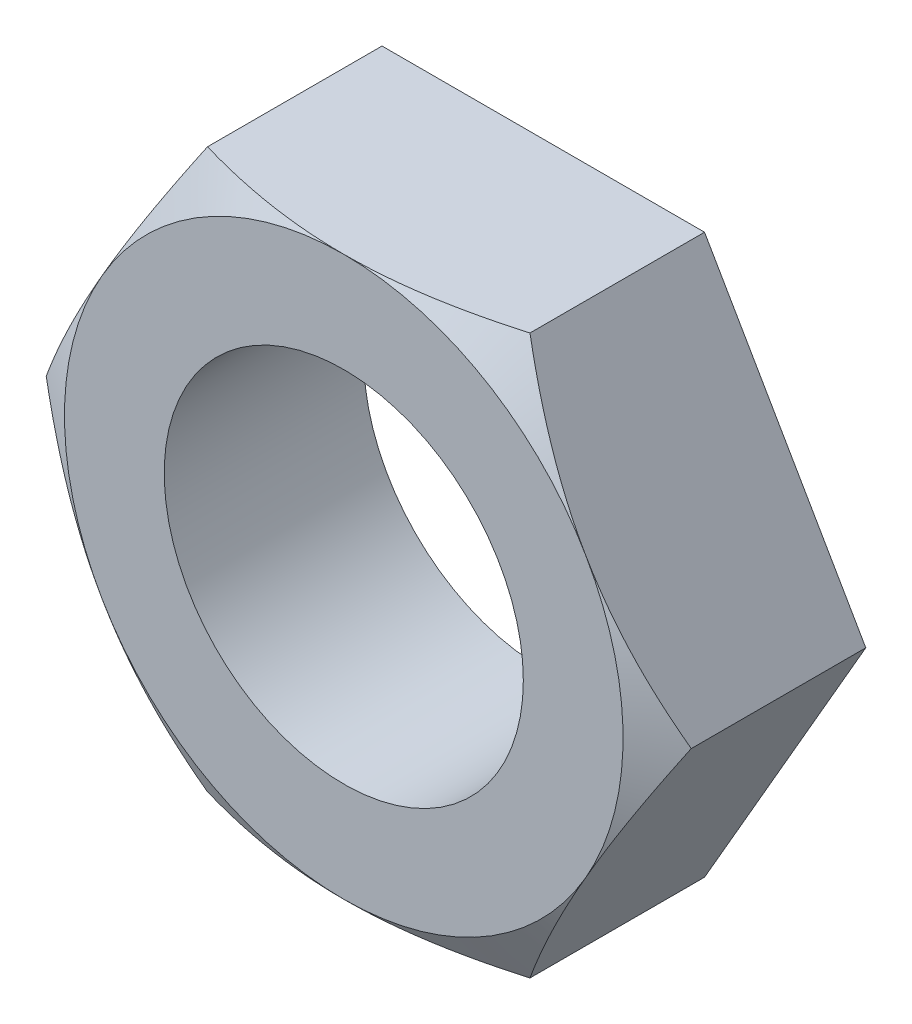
ISO-10303-21;
HEADER;
FILE_DESCRIPTION(('STEP AP214'),'2;1');
FILE_NAME('part.step','',(''),(''),'','','');
FILE_SCHEMA(('AUTOMOTIVE_DESIGN { 1 0 10303 214 1 1 1 1 }'));
ENDSEC;
DATA;
#1=APPLICATION_CONTEXT('core data for automotive mechanical design processes');
#2=APPLICATION_PROTOCOL_DEFINITION('international standard','automotive_design',2000,#1);
#3=PRODUCT_CONTEXT('',#1,'mechanical');
#4=PRODUCT('Part','Part','',(#3));
#5=PRODUCT_RELATED_PRODUCT_CATEGORY('part','',(#4));
#6=PRODUCT_DEFINITION_FORMATION('','',#4);
#7=PRODUCT_DEFINITION_CONTEXT('part definition',#1,'design');
#8=PRODUCT_DEFINITION('design','',#6,#7);
#9=PRODUCT_DEFINITION_SHAPE('','',#8);
#10=(LENGTH_UNIT() NAMED_UNIT(*) SI_UNIT(.MILLI.,.METRE.));
#11=(NAMED_UNIT(*) PLANE_ANGLE_UNIT() SI_UNIT($,.RADIAN.));
#12=(NAMED_UNIT(*) SI_UNIT($,.STERADIAN.) SOLID_ANGLE_UNIT());
#13=UNCERTAINTY_MEASURE_WITH_UNIT(LENGTH_MEASURE(1.E-05),#10,'distance_accuracy_value','');
#14=(GEOMETRIC_REPRESENTATION_CONTEXT(3) GLOBAL_UNCERTAINTY_ASSIGNED_CONTEXT((#13)) GLOBAL_UNIT_ASSIGNED_CONTEXT((#10,
#11,#12)) REPRESENTATION_CONTEXT('',''));
#15=CARTESIAN_POINT('',(0.,0.,0.));
#16=DIRECTION('',(0.,0.,1.));
#17=DIRECTION('',(1.,0.,0.));
#18=AXIS2_PLACEMENT_3D('',#15,#16,#17);
#19=CARTESIAN_POINT('',(-6.4158048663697,11.1125,7.93749999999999));
#20=DIRECTION('',(0.,0.,-1.));
#21=DIRECTION('',(-1.,0.,0.));
#22=AXIS2_PLACEMENT_3D('',#19,#20,#21);
#23=PLANE('',#22);
#24=CARTESIAN_POINT('',(0.,0.,7.93749999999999));
#25=DIRECTION('',(0.,0.,1.));
#26=DIRECTION('',(1.,0.,0.));
#27=AXIS2_PLACEMENT_3D('',#24,#25,#26);
#28=CIRCLE('',#27,7.14375);
#29=CARTESIAN_POINT('',(7.14375,0.,7.93749999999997));
#30=VERTEX_POINT('',#29);
#31=EDGE_CURVE('E174',#30,#30,#28,.T.);
#32=ORIENTED_EDGE('',*,*,#31,.F.);
#33=EDGE_LOOP('',(#32));
#34=FACE_BOUND('',#33,.T.);
#35=CARTESIAN_POINT('',(0.,0.,7.93749999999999));
#36=DIRECTION('',(0.,0.,1.));
#37=DIRECTION('',(1.,0.,0.));
#38=AXIS2_PLACEMENT_3D('',#35,#36,#37);
#39=CIRCLE('',#38,11.1125);
#40=CARTESIAN_POINT('',(0.,11.1125,7.93749999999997));
#41=VERTEX_POINT('',#40);
#42=CARTESIAN_POINT('',(-9.62370729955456,5.55624999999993,7.9375));
#43=VERTEX_POINT('',#42);
#44=EDGE_CURVE('E147',#41,#43,#39,.T.);
#45=ORIENTED_EDGE('',*,*,#44,.T.);
#46=CARTESIAN_POINT('',(-9.62370729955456,-5.55624999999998,7.9375));
#47=VERTEX_POINT('',#46);
#48=EDGE_CURVE('E295',#43,#47,#39,.T.);
#49=ORIENTED_EDGE('',*,*,#48,.T.);
#50=CARTESIAN_POINT('',(0.,-11.1125,7.93749999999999));
#51=VERTEX_POINT('',#50);
#52=EDGE_CURVE('E304',#47,#51,#39,.T.);
#53=ORIENTED_EDGE('',*,*,#52,.T.);
#54=CARTESIAN_POINT('',(9.62370729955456,-5.55624999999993,7.93749999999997));
#55=VERTEX_POINT('',#54);
#56=EDGE_CURVE('E47',#51,#55,#39,.T.);
#57=ORIENTED_EDGE('',*,*,#56,.T.);
#58=CARTESIAN_POINT('',(9.62370729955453,5.55624999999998,7.93749999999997));
#59=VERTEX_POINT('',#58);
#60=EDGE_CURVE('E55',#55,#59,#39,.T.);
#61=ORIENTED_EDGE('',*,*,#60,.T.);
#62=EDGE_CURVE('E305',#59,#41,#39,.T.);
#63=ORIENTED_EDGE('',*,*,#62,.T.);
#64=EDGE_LOOP('',(#45,#49,#53,#57,#61,#63));
#65=FACE_BOUND('',#64,.T.);
#66=ADVANCED_FACE('F26',(#34,#65),#23,.F.);
#67=CARTESIAN_POINT('',(-12.8316097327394,1.11022302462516E-13,7.93750000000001));
#68=DIRECTION('',(0.86602540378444,-0.499999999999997,0.));
#69=DIRECTION('',(0.499999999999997,0.86602540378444,0.));
#70=AXIS2_PLACEMENT_3D('',#67,#68,#69);
#71=PLANE('',#70);
#72=CARTESIAN_POINT('',(-6.4156893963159,11.1127,6.94490486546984));
#73=CARTESIAN_POINT('',(-6.556722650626,10.8684232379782,7.02631691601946));
#74=CARTESIAN_POINT('',(-6.69828174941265,10.6232356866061,7.1040339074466));
#75=CARTESIAN_POINT('',(-6.98253514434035,10.1308943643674,7.25105250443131));
#76=CARTESIAN_POINT('',(-7.1252297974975,9.88373997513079,7.32035134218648));
#77=CARTESIAN_POINT('',(-7.55561299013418,9.13829441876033,7.51427951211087));
#78=CARTESIAN_POINT('',(-7.84500052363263,8.63706050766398,7.62458478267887));
#79=CARTESIAN_POINT('',(-8.27805569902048,7.88698694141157,7.75392772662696));
#80=CARTESIAN_POINT('',(-8.42042957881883,7.64038814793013,7.79077261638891));
#81=CARTESIAN_POINT('',(-8.70583654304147,7.14604878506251,7.85255896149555));
#82=CARTESIAN_POINT('',(-8.84886964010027,6.89830819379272,7.87750018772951));
#83=CARTESIAN_POINT('',(-9.13517430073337,6.40241397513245,7.91484034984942));
#84=CARTESIAN_POINT('',(-9.27844537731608,6.15426119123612,7.92725419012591));
#85=CARTESIAN_POINT('',(-9.56512028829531,5.65772568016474,7.93927505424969));
#86=CARTESIAN_POINT('',(-9.70852411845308,5.40934296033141,7.93888247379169));
#87=CARTESIAN_POINT('',(-9.97661833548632,4.94499015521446,7.92618421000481));
#88=CARTESIAN_POINT('',(-10.1013278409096,4.72898695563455,7.91542743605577));
#89=CARTESIAN_POINT('',(-10.3504600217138,4.29747736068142,7.88443102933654));
#90=CARTESIAN_POINT('',(-10.4748826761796,4.08197100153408,7.8641907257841));
#91=CARTESIAN_POINT('',(-10.7233735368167,3.65157220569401,7.81458013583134));
#92=CARTESIAN_POINT('',(-10.8474413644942,3.43668042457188,7.78520230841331));
#93=CARTESIAN_POINT('',(-11.0949953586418,3.00790432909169,7.71783212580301));
#94=CARTESIAN_POINT('',(-11.2184814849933,2.79402008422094,7.67983918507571));
#95=CARTESIAN_POINT('',(-11.5933305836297,2.14476240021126,7.55197726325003));
#96=CARTESIAN_POINT('',(-11.8436080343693,1.7112691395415,7.44935893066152));
#97=CARTESIAN_POINT('',(-12.3404309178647,0.850746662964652,7.21645706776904));
#98=CARTESIAN_POINT('',(-12.5869827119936,0.423706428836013,7.08622823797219));
#99=CARTESIAN_POINT('',(-12.8317252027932,-0.000199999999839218,6.94490486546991));
#100=B_SPLINE_CURVE_WITH_KNOTS('',3,(#72,#73,#74,#75,#76,#77,#78,#79,#80,#81,#82,#83,#84,#85,
#86,#87,#88,#89,#90,#91,#92,#93,#94,#95,#96,#97,#98,#99),.UNSPECIFIED.,.F.,.F.,(4,2,2,2,2,2,2,2,
2,2,2,2,2,4),(0.,0.880670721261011,1.76163021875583,3.52729939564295,4.38846390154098,
5.24964498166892,6.10980026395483,6.96992896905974,7.71870115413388,8.46752630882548,
9.21697110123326,9.96646684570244,11.4984186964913,13.0273634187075),.UNSPECIFIED.);
#101=CARTESIAN_POINT('',(-6.41580486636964,11.1125,6.94497153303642));
#102=VERTEX_POINT('',#101);
#103=EDGE_CURVE('E144',#102,#43,#100,.T.);
#104=ORIENTED_EDGE('',*,*,#103,.F.);
#105=DIRECTION('',(0.,0.,-1.));
#106=VECTOR('',#105,1.);
#107=CARTESIAN_POINT('',(-6.4158048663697,11.1125,7.93749999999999));
#108=LINE('',#107,#106);
#109=CARTESIAN_POINT('',(-6.41580486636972,11.1125,0.));
#110=VERTEX_POINT('',#109);
#111=EDGE_CURVE('E128',#102,#110,#108,.T.);
#112=ORIENTED_EDGE('',*,*,#111,.T.);
#113=DIRECTION('',(-0.499999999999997,-0.86602540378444,0.));
#114=VECTOR('',#113,1.);
#115=CARTESIAN_POINT('',(-12.8316097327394,1.11022302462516E-13,0.));
#116=LINE('',#115,#114);
#117=CARTESIAN_POINT('',(-12.8316097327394,1.11022302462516E-13,0.));
#118=VERTEX_POINT('',#117);
#119=EDGE_CURVE('E172',#110,#118,#116,.T.);
#120=ORIENTED_EDGE('',*,*,#119,.T.);
#121=DIRECTION('',(0.,0.,-1.));
#122=VECTOR('',#121,1.);
#123=CARTESIAN_POINT('',(-12.8316097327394,1.11022302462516E-13,7.93750000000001));
#124=LINE('',#123,#122);
#125=CARTESIAN_POINT('',(-12.8316097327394,1.11022302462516E-13,6.94497153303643));
#126=VERTEX_POINT('',#125);
#127=EDGE_CURVE('E132',#126,#118,#124,.T.);
#128=ORIENTED_EDGE('',*,*,#127,.F.);
#129=EDGE_CURVE('E155',#43,#126,#100,.T.);
#130=ORIENTED_EDGE('',*,*,#129,.F.);
#131=EDGE_LOOP('',(#104,#112,#120,#128,#130));
#132=FACE_BOUND('',#131,.T.);
#133=ADVANCED_FACE('F28',(#132),#71,.F.);
#134=CARTESIAN_POINT('',(-6.41580486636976,-11.1125,7.9375));
#135=DIRECTION('',(0.86602540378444,0.499999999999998,0.));
#136=DIRECTION('',(-0.499999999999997,0.86602540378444,0.));
#137=AXIS2_PLACEMENT_3D('',#134,#135,#136);
#138=PLANE('',#137);
#139=CARTESIAN_POINT('',(-12.8317252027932,0.000200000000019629,6.94490486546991));
#140=CARTESIAN_POINT('',(-12.6906919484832,-0.24407676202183,7.02631691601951));
#141=CARTESIAN_POINT('',(-12.5491328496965,-0.489264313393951,7.10403390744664));
#142=CARTESIAN_POINT('',(-12.2648794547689,-0.981605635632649,7.25105250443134));
#143=CARTESIAN_POINT('',(-12.1221848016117,-1.22876002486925,7.32035134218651));
#144=CARTESIAN_POINT('',(-11.691801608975,-1.97420558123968,7.5142795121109));
#145=CARTESIAN_POINT('',(-11.4024140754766,-2.47543949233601,7.62458478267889));
#146=CARTESIAN_POINT('',(-10.9693589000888,-3.2255130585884,7.75392772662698));
#147=CARTESIAN_POINT('',(-10.8269850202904,-3.47211185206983,7.79077261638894));
#148=CARTESIAN_POINT('',(-10.5415780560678,-3.96645121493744,7.85255896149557));
#149=CARTESIAN_POINT('',(-10.398544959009,-4.21419180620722,7.87750018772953));
#150=CARTESIAN_POINT('',(-10.1122402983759,-4.71008602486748,7.91484034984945));
#151=CARTESIAN_POINT('',(-9.9689692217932,-4.95823880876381,7.92725419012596));
#152=CARTESIAN_POINT('',(-9.68229431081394,-5.45477431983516,7.9392750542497));
#153=CARTESIAN_POINT('',(-9.53889048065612,-5.70315703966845,7.93888247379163));
#154=CARTESIAN_POINT('',(-9.27079626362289,-6.16750984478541,7.92618421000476));
#155=CARTESIAN_POINT('',(-9.1460867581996,-6.38351304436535,7.91542743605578));
#156=CARTESIAN_POINT('',(-8.8969545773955,-6.81502263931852,7.88443102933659));
#157=CARTESIAN_POINT('',(-8.7725319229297,-7.03052899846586,7.86419072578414));
#158=CARTESIAN_POINT('',(-8.52404106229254,-7.46092779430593,7.81458013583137));
#159=CARTESIAN_POINT('',(-8.39997323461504,-7.67581957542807,7.78520230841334));
#160=CARTESIAN_POINT('',(-8.15241924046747,-8.10459567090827,7.71783212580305));
#161=CARTESIAN_POINT('',(-8.02893311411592,-8.31847991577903,7.67983918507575));
#162=CARTESIAN_POINT('',(-7.6540840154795,-8.96773759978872,7.55197726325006));
#163=CARTESIAN_POINT('',(-7.40380656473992,-9.4012308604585,7.44935893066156));
#164=CARTESIAN_POINT('',(-6.90698368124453,-10.2617533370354,7.21645706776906));
#165=CARTESIAN_POINT('',(-6.66043188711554,-10.688793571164,7.08622823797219));
#166=CARTESIAN_POINT('',(-6.41568939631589,-11.1126999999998,6.94490486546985));
#167=B_SPLINE_CURVE_WITH_KNOTS('',3,(#139,#140,#141,#142,#143,#144,#145,#146,#147,#148,#149,
#150,#151,#152,#153,#154,#155,#156,#157,#158,#159,#160,#161,#162,#163,#164,#165,#166),
.UNSPECIFIED.,.F.,.F.,(4,2,2,2,2,2,2,2,2,2,2,2,2,4),(0.,0.880670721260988,1.76163021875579,
3.52729939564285,4.38846390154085,5.24964498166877,6.10980026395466,6.96992896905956,
7.71870115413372,8.46752630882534,9.21697110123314,9.96646684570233,11.4984186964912,
13.0273634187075),.UNSPECIFIED.);
#168=EDGE_CURVE('E182',#126,#47,#167,.T.);
#169=ORIENTED_EDGE('',*,*,#168,.F.);
#170=ORIENTED_EDGE('',*,*,#127,.T.);
#171=DIRECTION('',(0.499999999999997,-0.86602540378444,0.));
#172=VECTOR('',#171,1.);
#173=CARTESIAN_POINT('',(-6.4158048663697,-11.1124999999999,0.));
#174=LINE('',#173,#172);
#175=CARTESIAN_POINT('',(-6.4158048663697,-11.1124999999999,0.));
#176=VERTEX_POINT('',#175);
#177=EDGE_CURVE('E170',#118,#176,#174,.T.);
#178=ORIENTED_EDGE('',*,*,#177,.T.);
#179=DIRECTION('',(0.,0.,-1.));
#180=VECTOR('',#179,1.);
#181=CARTESIAN_POINT('',(-6.41580486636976,-11.1125,7.9375));
#182=LINE('',#181,#180);
#183=CARTESIAN_POINT('',(-6.41580486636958,-11.1124999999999,6.94497153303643));
#184=VERTEX_POINT('',#183);
#185=EDGE_CURVE('E126',#184,#176,#182,.T.);
#186=ORIENTED_EDGE('',*,*,#185,.F.);
#187=EDGE_CURVE('E183',#47,#184,#167,.T.);
#188=ORIENTED_EDGE('',*,*,#187,.F.);
#189=EDGE_LOOP('',(#169,#170,#178,#186,#188));
#190=FACE_BOUND('',#189,.T.);
#191=ADVANCED_FACE('F218',(#190),#138,.F.);
#192=CARTESIAN_POINT('',(6.41580486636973,-11.1124999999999,7.93749999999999));
#193=DIRECTION('',(0.,1.,0.));
#194=DIRECTION('',(0.,0.,1.));
#195=AXIS2_PLACEMENT_3D('',#192,#193,#194);
#196=PLANE('',#195);
#197=CARTESIAN_POINT('',(-17.0156599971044,-11.1125,2.61987198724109));
#198=CARTESIAN_POINT('',(-16.7717182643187,-11.1124999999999,2.73778980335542));
#199=CARTESIAN_POINT('',(-16.5274816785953,-11.1124999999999,2.85509734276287));
#200=CARTESIAN_POINT('',(-16.0383565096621,-11.1124999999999,3.08835178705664));
#201=CARTESIAN_POINT('',(-15.793467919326,-11.1124999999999,3.20429867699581));
#202=CARTESIAN_POINT('',(-15.0576589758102,-11.1124999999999,3.54992184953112));
#203=CARTESIAN_POINT('',(-14.5656747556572,-11.1124999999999,3.77734218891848));
#204=CARTESIAN_POINT('',(-13.5754912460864,-11.1124999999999,4.22600012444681));
#205=CARTESIAN_POINT('',(-13.0772725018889,-11.1124999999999,4.44719489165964));
#206=CARTESIAN_POINT('',(-12.0767406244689,-11.1124999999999,4.88008735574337));
#207=CARTESIAN_POINT('',(-11.5744277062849,-11.1124999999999,5.09178554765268));
#208=CARTESIAN_POINT('',(-10.558672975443,-11.1124999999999,5.50566674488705));
#209=CARTESIAN_POINT('',(-10.0451702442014,-11.1124999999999,5.70770102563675));
#210=CARTESIAN_POINT('',(-9.01210438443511,-11.1124999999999,6.0959470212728));
#211=CARTESIAN_POINT('',(-8.49254058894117,-11.1124999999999,6.28215697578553));
#212=CARTESIAN_POINT('',(-7.44761025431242,-11.1124999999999,6.63374839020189));
#213=CARTESIAN_POINT('',(-6.922258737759,-11.1124999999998,6.79917413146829));
#214=CARTESIAN_POINT('',(-5.86403653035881,-11.1124999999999,7.10383275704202));
#215=CARTESIAN_POINT('',(-5.33116827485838,-11.1125000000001,7.24307392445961));
#216=CARTESIAN_POINT('',(-4.52612699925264,-11.1125,7.4272000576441));
#217=CARTESIAN_POINT('',(-4.256766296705,-11.1124999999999,7.48446225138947));
#218=CARTESIAN_POINT('',(-3.71625195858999,-11.1124999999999,7.58983726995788));
#219=CARTESIAN_POINT('',(-3.44509836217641,-11.1124999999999,7.63795029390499));
#220=CARTESIAN_POINT('',(-2.90117489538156,-11.1124999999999,7.72417482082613));
#221=CARTESIAN_POINT('',(-2.62840489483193,-11.1124999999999,7.76228550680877));
#222=CARTESIAN_POINT('',(-2.08157789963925,-11.1124999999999,7.82773723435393));
#223=CARTESIAN_POINT('',(-1.80752095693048,-11.1124999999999,7.85507870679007));
#224=CARTESIAN_POINT('',(-1.2602430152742,-11.1124999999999,7.89825862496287));
#225=CARTESIAN_POINT('',(-0.987027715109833,-11.1124999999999,7.91416882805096));
#226=CARTESIAN_POINT('',(-0.440169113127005,-11.1124999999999,7.93440171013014));
#227=CARTESIAN_POINT('',(-0.16652581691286,-11.1124999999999,7.93872453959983));
#228=CARTESIAN_POINT('',(0.380619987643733,-11.1124999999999,7.93568011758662));
#229=CARTESIAN_POINT('',(0.654122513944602,-11.1124999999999,7.92831614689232));
#230=CARTESIAN_POINT('',(1.20057875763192,-11.1124999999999,7.90208112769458));
#231=CARTESIAN_POINT('',(1.47353244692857,-11.1124999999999,7.88320950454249));
#232=CARTESIAN_POINT('',(2.13508817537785,-11.1124999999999,7.82391840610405));
#233=CARTESIAN_POINT('',(2.52318193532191,-11.1124999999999,7.77773319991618));
#234=CARTESIAN_POINT('',(3.29639549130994,-11.1124999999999,7.66466269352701));
#235=CARTESIAN_POINT('',(3.68151444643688,-11.1124999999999,7.59777174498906));
#236=CARTESIAN_POINT('',(4.44846072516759,-11.1124999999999,7.44566216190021));
#237=CARTESIAN_POINT('',(4.83028457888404,-11.1124999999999,7.36042619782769));
#238=CARTESIAN_POINT('',(5.5900038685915,-11.1124999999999,7.17422723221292));
#239=CARTESIAN_POINT('',(5.96789967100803,-11.1124999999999,7.07326571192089));
#240=CARTESIAN_POINT('',(6.72907033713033,-11.1124999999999,6.85539190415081));
#241=CARTESIAN_POINT('',(7.11224999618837,-11.1124999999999,6.73814929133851));
#242=CARTESIAN_POINT('',(7.87455909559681,-11.1124999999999,6.49207981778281));
#243=CARTESIAN_POINT('',(8.25369113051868,-11.1124999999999,6.36326094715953));
#244=CARTESIAN_POINT('',(9.00638366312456,-11.1124999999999,6.09669983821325));
#245=CARTESIAN_POINT('',(9.37996350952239,-11.1124999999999,5.9590119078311));
#246=CARTESIAN_POINT('',(10.1242247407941,-11.1124999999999,5.67555454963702));
#247=CARTESIAN_POINT('',(10.4949048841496,-11.1124999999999,5.52978185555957));
#248=CARTESIAN_POINT('',(10.8642383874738,-11.1125,5.38076654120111));
#249=B_SPLINE_CURVE_WITH_KNOTS('',3,(#197,#198,#199,#200,#201,#202,#203,#204,#205,#206,#207,
#208,#209,#210,#211,#212,#213,#214,#215,#216,#217,#218,#219,#220,#221,#222,#223,#224,#225,#226,
#227,#228,#229,#230,#231,#232,#233,#234,#235,#236,#237,#238,#239,#240,#241,#242,#243,#244,#245,
#246,#247,#248),.UNSPECIFIED.,.F.,.F.,(4,2,2,2,2,2,2,2,2,2,2,2,2,2,2,2,2,2,2,2,2,2,2,2,2,4),(0.,
0.812838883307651,1.62568668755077,3.2516466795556,4.88691138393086,6.5220907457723,
8.17734503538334,9.83278322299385,11.4846323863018,13.1359581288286,13.9619677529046,
14.7879593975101,15.6140184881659,16.44004452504,17.2608389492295,18.0816227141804,
18.9021761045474,19.7227704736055,20.8946141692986,22.0667778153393,23.2400536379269,
24.4132190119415,25.6151411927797,26.8162400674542,28.010578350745,29.2054027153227),.UNSPECIFIED.);
#250=EDGE_CURVE('E214',#184,#51,#249,.T.);
#251=ORIENTED_EDGE('',*,*,#250,.F.);
#252=ORIENTED_EDGE('',*,*,#185,.T.);
#253=DIRECTION('',(1.,0.,0.));
#254=VECTOR('',#253,1.);
#255=CARTESIAN_POINT('',(6.41580486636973,-11.1124999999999,0.));
#256=LINE('',#255,#254);
#257=CARTESIAN_POINT('',(6.41580486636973,-11.1124999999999,0.));
#258=VERTEX_POINT('',#257);
#259=EDGE_CURVE('E167',#176,#258,#256,.T.);
#260=ORIENTED_EDGE('',*,*,#259,.T.);
#261=DIRECTION('',(0.,0.,-1.));
#262=VECTOR('',#261,1.);
#263=CARTESIAN_POINT('',(6.41580486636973,-11.1124999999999,7.93749999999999));
#264=LINE('',#263,#262);
#265=CARTESIAN_POINT('',(6.41580486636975,-11.1124999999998,6.94497153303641));
#266=VERTEX_POINT('',#265);
#267=EDGE_CURVE('E123',#266,#258,#264,.T.);
#268=ORIENTED_EDGE('',*,*,#267,.F.);
#269=EDGE_CURVE('E209',#51,#266,#249,.T.);
#270=ORIENTED_EDGE('',*,*,#269,.F.);
#271=EDGE_LOOP('',(#251,#252,#260,#268,#270));
#272=FACE_BOUND('',#271,.T.);
#273=ADVANCED_FACE('F215',(#272),#196,.F.);
#274=CARTESIAN_POINT('',(12.8316097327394,1.66533453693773E-13,7.93749999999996));
#275=DIRECTION('',(-0.866025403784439,0.499999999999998,0.));
#276=DIRECTION('',(-0.499999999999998,-0.86602540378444,0.));
#277=AXIS2_PLACEMENT_3D('',#274,#275,#276);
#278=PLANE('',#277);
#279=CARTESIAN_POINT('',(6.41568939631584,-11.1127,6.94490486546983));
#280=CARTESIAN_POINT('',(6.55672265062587,-10.8684232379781,7.02631691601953));
#281=CARTESIAN_POINT('',(6.69828174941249,-10.623235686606,7.1040339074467));
#282=CARTESIAN_POINT('',(6.98253514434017,-10.1308943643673,7.25105250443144));
#283=CARTESIAN_POINT('',(7.12522979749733,-9.88373997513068,7.3203513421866));
#284=CARTESIAN_POINT('',(7.55561299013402,-9.13829441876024,7.51427951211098));
#285=CARTESIAN_POINT('',(7.84500052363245,-8.6370605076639,7.62458478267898));
#286=CARTESIAN_POINT('',(8.27805569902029,-7.8869869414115,7.75392772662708));
#287=CARTESIAN_POINT('',(8.42042957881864,-7.64038814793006,7.79077261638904));
#288=CARTESIAN_POINT('',(8.70583654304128,-7.14604878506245,7.85255896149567));
#289=CARTESIAN_POINT('',(8.84886964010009,-6.89830819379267,7.87750018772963));
#290=CARTESIAN_POINT('',(9.13517430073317,-6.40241397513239,7.91484034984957));
#291=CARTESIAN_POINT('',(9.27844537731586,-6.15426119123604,7.9272541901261));
#292=CARTESIAN_POINT('',(9.56512028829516,-5.6577256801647,7.93927505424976));
#293=CARTESIAN_POINT('',(9.70852411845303,-5.40934296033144,7.93888247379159));
#294=CARTESIAN_POINT('',(9.97661833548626,-4.94499015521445,7.92618421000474));
#295=CARTESIAN_POINT('',(10.1013278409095,-4.72898695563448,7.91542743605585));
#296=CARTESIAN_POINT('',(10.3504600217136,-4.29747736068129,7.88443102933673));
#297=CARTESIAN_POINT('',(10.4748826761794,-4.08197100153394,7.86419072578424));
#298=CARTESIAN_POINT('',(10.7233735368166,-3.65157220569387,7.81458013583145));
#299=CARTESIAN_POINT('',(10.8474413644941,-3.43668042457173,7.78520230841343));
#300=CARTESIAN_POINT('',(11.0949953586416,-3.00790432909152,7.71783212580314));
#301=CARTESIAN_POINT('',(11.2184814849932,-2.79402008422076,7.67983918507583));
#302=CARTESIAN_POINT('',(11.5933305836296,-2.14476240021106,7.55197726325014));
#303=CARTESIAN_POINT('',(11.8436080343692,-1.71126913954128,7.44935893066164));
#304=CARTESIAN_POINT('',(12.3404309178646,-0.850746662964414,7.21645706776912));
#305=CARTESIAN_POINT('',(12.5869827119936,-0.42370642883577,7.08622823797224));
#306=CARTESIAN_POINT('',(12.8317252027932,0.000200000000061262,6.94490486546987));
#307=B_SPLINE_CURVE_WITH_KNOTS('',3,(#279,#280,#281,#282,#283,#284,#285,#286,#287,#288,#289,
#290,#291,#292,#293,#294,#295,#296,#297,#298,#299,#300,#301,#302,#303,#304,#305,#306),
.UNSPECIFIED.,.F.,.F.,(4,2,2,2,2,2,2,2,2,2,2,2,2,4),(0.,0.880670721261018,1.76163021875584,
3.52729939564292,4.38846390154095,5.24964498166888,6.10980026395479,6.96992896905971,
7.7187011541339,8.46752630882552,9.21697110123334,9.96646684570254,11.4984186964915,
13.0273634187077),.UNSPECIFIED.);
#308=EDGE_CURVE('E109',#266,#55,#307,.T.);
#309=ORIENTED_EDGE('',*,*,#308,.F.);
#310=ORIENTED_EDGE('',*,*,#267,.T.);
#311=DIRECTION('',(0.499999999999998,0.866025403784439,0.));
#312=VECTOR('',#311,1.);
#313=CARTESIAN_POINT('',(12.8316097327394,0.,0.));
#314=LINE('',#313,#312);
#315=CARTESIAN_POINT('',(12.8316097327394,0.,0.));
#316=VERTEX_POINT('',#315);
#317=EDGE_CURVE('E121',#258,#316,#314,.T.);
#318=ORIENTED_EDGE('',*,*,#317,.T.);
#319=DIRECTION('',(0.,0.,-1.));
#320=VECTOR('',#319,1.);
#321=CARTESIAN_POINT('',(12.8316097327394,1.66533453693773E-13,7.93749999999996));
#322=LINE('',#321,#320);
#323=CARTESIAN_POINT('',(12.8316097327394,0.,6.94497153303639));
#324=VERTEX_POINT('',#323);
#325=EDGE_CURVE('E114',#324,#316,#322,.T.);
#326=ORIENTED_EDGE('',*,*,#325,.F.);
#327=EDGE_CURVE('E101',#55,#324,#307,.T.);
#328=ORIENTED_EDGE('',*,*,#327,.F.);
#329=EDGE_LOOP('',(#309,#310,#318,#326,#328));
#330=FACE_BOUND('',#329,.T.);
#331=ADVANCED_FACE('F119',(#330),#278,.F.);
#332=CARTESIAN_POINT('',(6.41580486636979,11.1125000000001,7.93749999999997));
#333=DIRECTION('',(-0.86602540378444,-0.499999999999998,0.));
#334=DIRECTION('',(0.499999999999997,-0.86602540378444,0.));
#335=AXIS2_PLACEMENT_3D('',#332,#333,#334);
#336=PLANE('',#335);
#337=CARTESIAN_POINT('',(12.8317252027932,-0.000200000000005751,6.94490486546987));
#338=CARTESIAN_POINT('',(12.6906919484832,0.244076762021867,7.0263169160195));
#339=CARTESIAN_POINT('',(12.5491328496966,0.489264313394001,7.10403390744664));
#340=CARTESIAN_POINT('',(12.2648794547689,0.981605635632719,7.25105250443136));
#341=CARTESIAN_POINT('',(12.1221848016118,1.22876002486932,7.32035134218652));
#342=CARTESIAN_POINT('',(11.6918016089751,1.97420558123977,7.51427951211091));
#343=CARTESIAN_POINT('',(11.4024140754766,2.47543949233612,7.6245847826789));
#344=CARTESIAN_POINT('',(10.9693589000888,3.22551305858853,7.75392772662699));
#345=CARTESIAN_POINT('',(10.8269850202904,3.47211185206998,7.79077261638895));
#346=CARTESIAN_POINT('',(10.5415780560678,3.9664512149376,7.85255896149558));
#347=CARTESIAN_POINT('',(10.398544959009,4.21419180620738,7.87750018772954));
#348=CARTESIAN_POINT('',(10.1122402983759,4.71008602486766,7.91484034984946));
#349=CARTESIAN_POINT('',(9.96896922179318,4.958238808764,7.92725419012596));
#350=CARTESIAN_POINT('',(9.68229431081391,5.45477431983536,7.93927505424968));
#351=CARTESIAN_POINT('',(9.53889048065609,5.70315703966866,7.93888247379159));
#352=CARTESIAN_POINT('',(9.27079626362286,6.16750984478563,7.92618421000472));
#353=CARTESIAN_POINT('',(9.14608675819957,6.38351304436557,7.91542743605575));
#354=CARTESIAN_POINT('',(8.89695457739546,6.81502263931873,7.88443102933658));
#355=CARTESIAN_POINT('',(8.77253192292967,7.03052899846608,7.86419072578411));
#356=CARTESIAN_POINT('',(8.52404106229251,7.46092779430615,7.81458013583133));
#357=CARTESIAN_POINT('',(8.39997323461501,7.67581957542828,7.7852023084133));
#358=CARTESIAN_POINT('',(8.15241924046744,8.10459567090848,7.71783212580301));
#359=CARTESIAN_POINT('',(8.02893311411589,8.31847991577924,7.67983918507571));
#360=CARTESIAN_POINT('',(7.65408401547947,8.96773759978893,7.55197726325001));
#361=CARTESIAN_POINT('',(7.40380656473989,9.4012308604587,7.44935893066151));
#362=CARTESIAN_POINT('',(6.90698368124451,10.2617533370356,7.216457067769));
#363=CARTESIAN_POINT('',(6.66043188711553,10.6887935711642,7.08622823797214));
#364=CARTESIAN_POINT('',(6.41568939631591,11.1127,6.94490486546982));
#365=B_SPLINE_CURVE_WITH_KNOTS('',3,(#337,#338,#339,#340,#341,#342,#343,#344,#345,#346,#347,
#348,#349,#350,#351,#352,#353,#354,#355,#356,#357,#358,#359,#360,#361,#362,#363,#364),
.UNSPECIFIED.,.F.,.F.,(4,2,2,2,2,2,2,2,2,2,2,2,2,4),(0.,0.880670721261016,1.76163021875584,
3.52729939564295,4.38846390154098,5.24964498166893,6.10980026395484,6.96992896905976,
7.71870115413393,8.46752630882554,9.21697110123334,9.96646684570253,11.4984186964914,
13.0273634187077),.UNSPECIFIED.);
#366=EDGE_CURVE('E104',#324,#59,#365,.T.);
#367=ORIENTED_EDGE('',*,*,#366,.F.);
#368=ORIENTED_EDGE('',*,*,#325,.T.);
#369=DIRECTION('',(-0.499999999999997,0.86602540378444,0.));
#370=VECTOR('',#369,1.);
#371=CARTESIAN_POINT('',(6.41580486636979,11.1125000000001,0.));
#372=LINE('',#371,#370);
#373=CARTESIAN_POINT('',(6.41580486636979,11.1125000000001,0.));
#374=VERTEX_POINT('',#373);
#375=EDGE_CURVE('E162',#316,#374,#372,.T.);
#376=ORIENTED_EDGE('',*,*,#375,.T.);
#377=DIRECTION('',(0.,0.,-1.));
#378=VECTOR('',#377,1.);
#379=CARTESIAN_POINT('',(6.41580486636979,11.1125000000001,7.93749999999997));
#380=LINE('',#379,#378);
#381=CARTESIAN_POINT('',(6.41580486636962,11.1125,6.94497153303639));
#382=VERTEX_POINT('',#381);
#383=EDGE_CURVE('E124',#382,#374,#380,.T.);
#384=ORIENTED_EDGE('',*,*,#383,.F.);
#385=EDGE_CURVE('E117',#59,#382,#365,.T.);
#386=ORIENTED_EDGE('',*,*,#385,.F.);
#387=EDGE_LOOP('',(#367,#368,#376,#384,#386));
#388=FACE_BOUND('',#387,.T.);
#389=ADVANCED_FACE('F112',(#388),#336,.F.);
#390=CARTESIAN_POINT('',(-6.4158048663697,11.1125,7.93749999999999));
#391=DIRECTION('',(0.,-1.,0.));
#392=DIRECTION('',(0.,0.,-1.));
#393=AXIS2_PLACEMENT_3D('',#390,#391,#392);
#394=PLANE('',#393);
#395=CARTESIAN_POINT('',(-17.0156599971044,11.1125,2.61987198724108));
#396=CARTESIAN_POINT('',(-16.7717182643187,11.1125,2.73778980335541));
#397=CARTESIAN_POINT('',(-16.5274816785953,11.1125,2.85509734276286));
#398=CARTESIAN_POINT('',(-16.0383565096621,11.1125,3.08835178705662));
#399=CARTESIAN_POINT('',(-15.793467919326,11.1125,3.20429867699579));
#400=CARTESIAN_POINT('',(-15.0576589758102,11.1125,3.5499218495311));
#401=CARTESIAN_POINT('',(-14.5656747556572,11.1125,3.77734218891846));
#402=CARTESIAN_POINT('',(-13.5754912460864,11.1125,4.22600012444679));
#403=CARTESIAN_POINT('',(-13.0772725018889,11.1125,4.44719489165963));
#404=CARTESIAN_POINT('',(-12.0767406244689,11.1125,4.88008735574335));
#405=CARTESIAN_POINT('',(-11.5744277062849,11.1125,5.09178554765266));
#406=CARTESIAN_POINT('',(-10.558672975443,11.1125,5.50566674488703));
#407=CARTESIAN_POINT('',(-10.0451702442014,11.1125,5.70770102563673));
#408=CARTESIAN_POINT('',(-9.01210438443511,11.1125,6.09594702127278));
#409=CARTESIAN_POINT('',(-8.49254058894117,11.1125,6.28215697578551));
#410=CARTESIAN_POINT('',(-7.44761025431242,11.1125,6.63374839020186));
#411=CARTESIAN_POINT('',(-6.922258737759,11.1125,6.79917413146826));
#412=CARTESIAN_POINT('',(-5.86403653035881,11.1125,7.103832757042));
#413=CARTESIAN_POINT('',(-5.33116827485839,11.1125,7.24307392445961));
#414=CARTESIAN_POINT('',(-4.52612699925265,11.1125,7.42720005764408));
#415=CARTESIAN_POINT('',(-4.25676629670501,11.1125,7.48446225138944));
#416=CARTESIAN_POINT('',(-3.71625195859,11.1125,7.58983726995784));
#417=CARTESIAN_POINT('',(-3.44509836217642,11.1125,7.63795029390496));
#418=CARTESIAN_POINT('',(-2.90117489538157,11.1125,7.7241748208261));
#419=CARTESIAN_POINT('',(-2.62840489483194,11.1125,7.76228550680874));
#420=CARTESIAN_POINT('',(-2.08157789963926,11.1125,7.82773723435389));
#421=CARTESIAN_POINT('',(-1.8075209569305,11.1125,7.85507870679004));
#422=CARTESIAN_POINT('',(-1.26024301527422,11.1125,7.89825862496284));
#423=CARTESIAN_POINT('',(-0.98702771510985,11.1125,7.91416882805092));
#424=CARTESIAN_POINT('',(-0.440169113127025,11.1125,7.93440171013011));
#425=CARTESIAN_POINT('',(-0.166525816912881,11.1125,7.9387245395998));
#426=CARTESIAN_POINT('',(0.380619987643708,11.1125,7.93568011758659));
#427=CARTESIAN_POINT('',(0.654122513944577,11.1125,7.92831614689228));
#428=CARTESIAN_POINT('',(1.2005787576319,11.1125,7.90208112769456));
#429=CARTESIAN_POINT('',(1.47353244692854,11.1125,7.88320950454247));
#430=CARTESIAN_POINT('',(2.13508817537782,11.1125,7.82391840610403));
#431=CARTESIAN_POINT('',(2.52318193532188,11.1125,7.77773319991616));
#432=CARTESIAN_POINT('',(3.29639549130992,11.1125,7.66466269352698));
#433=CARTESIAN_POINT('',(3.68151444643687,11.1125,7.59777174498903));
#434=CARTESIAN_POINT('',(4.44846072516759,11.1125,7.44566216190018));
#435=CARTESIAN_POINT('',(4.83028457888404,11.1125,7.36042619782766));
#436=CARTESIAN_POINT('',(5.59000386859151,11.1125,7.17422723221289));
#437=CARTESIAN_POINT('',(5.96789967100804,11.1125,7.07326571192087));
#438=CARTESIAN_POINT('',(6.72907033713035,11.1125,6.85539190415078));
#439=CARTESIAN_POINT('',(7.11224999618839,11.1125,6.73814929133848));
#440=CARTESIAN_POINT('',(7.87455909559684,11.1125,6.49207981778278));
#441=CARTESIAN_POINT('',(8.25369113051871,11.1125,6.36326094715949));
#442=CARTESIAN_POINT('',(9.0063836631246,11.1125,6.09669983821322));
#443=CARTESIAN_POINT('',(9.37996350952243,11.1125,5.95901190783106));
#444=CARTESIAN_POINT('',(10.1242247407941,11.1125,5.67555454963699));
#445=CARTESIAN_POINT('',(10.4949048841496,11.1125,5.52978185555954));
#446=CARTESIAN_POINT('',(10.8642383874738,11.1125,5.38076654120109));
#447=B_SPLINE_CURVE_WITH_KNOTS('',3,(#395,#396,#397,#398,#399,#400,#401,#402,#403,#404,#405,
#406,#407,#408,#409,#410,#411,#412,#413,#414,#415,#416,#417,#418,#419,#420,#421,#422,#423,#424,
#425,#426,#427,#428,#429,#430,#431,#432,#433,#434,#435,#436,#437,#438,#439,#440,#441,#442,#443,
#444,#445,#446),.UNSPECIFIED.,.F.,.F.,(4,2,2,2,2,2,2,2,2,2,2,2,2,2,2,2,2,2,2,2,2,2,2,2,2,4),(0.,
0.81283888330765,1.62568668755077,3.25164667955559,4.88691138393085,6.5220907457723,
8.17734503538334,9.83278322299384,11.4846323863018,13.1359581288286,13.9619677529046,
14.7879593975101,15.6140184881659,16.44004452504,17.2608389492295,18.0816227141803,
18.9021761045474,19.7227704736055,20.8946141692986,22.0667778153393,23.2400536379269,
24.4132190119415,25.6151411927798,26.8162400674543,28.0105783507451,29.2054027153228),.UNSPECIFIED.);
#448=EDGE_CURVE('E11',#382,#41,#447,.F.);
#449=ORIENTED_EDGE('',*,*,#448,.F.);
#450=ORIENTED_EDGE('',*,*,#383,.T.);
#451=DIRECTION('',(-1.,0.,0.));
#452=VECTOR('',#451,1.);
#453=CARTESIAN_POINT('',(-6.41580486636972,11.1125,0.));
#454=LINE('',#453,#452);
#455=EDGE_CURVE('E160',#374,#110,#454,.T.);
#456=ORIENTED_EDGE('',*,*,#455,.T.);
#457=ORIENTED_EDGE('',*,*,#111,.F.);
#458=EDGE_CURVE('E31',#41,#102,#447,.F.);
#459=ORIENTED_EDGE('',*,*,#458,.F.);
#460=EDGE_LOOP('',(#449,#450,#456,#457,#459));
#461=FACE_BOUND('',#460,.T.);
#462=ADVANCED_FACE('F158',(#461),#394,.F.);
#463=CARTESIAN_POINT('',(-6.41580486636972,11.1125,0.));
#464=DIRECTION('',(0.,0.,-1.));
#465=DIRECTION('',(-1.,0.,0.));
#466=AXIS2_PLACEMENT_3D('',#463,#464,#465);
#467=PLANE('',#466);
#468=ORIENTED_EDGE('',*,*,#119,.F.);
#469=ORIENTED_EDGE('',*,*,#455,.F.);
#470=ORIENTED_EDGE('',*,*,#375,.F.);
#471=ORIENTED_EDGE('',*,*,#317,.F.);
#472=ORIENTED_EDGE('',*,*,#259,.F.);
#473=ORIENTED_EDGE('',*,*,#177,.F.);
#474=EDGE_LOOP('',(#468,#469,#470,#471,#472,#473));
#475=FACE_BOUND('',#474,.T.);
#476=CARTESIAN_POINT('',(0.,0.,0.));
#477=DIRECTION('',(0.,0.,1.));
#478=DIRECTION('',(1.,0.,0.));
#479=AXIS2_PLACEMENT_3D('',#476,#477,#478);
#480=CIRCLE('',#479,7.14375);
#481=CARTESIAN_POINT('',(7.14375,0.,0.));
#482=VERTEX_POINT('',#481);
#483=EDGE_CURVE('E156',#482,#482,#480,.T.);
#484=ORIENTED_EDGE('',*,*,#483,.T.);
#485=EDGE_LOOP('',(#484));
#486=FACE_BOUND('',#485,.T.);
#487=ADVANCED_FACE('F233',(#475,#486),#467,.T.);
#488=CARTESIAN_POINT('',(0.,0.,7.93749999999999));
#489=DIRECTION('',(0.,0.,-1.));
#490=DIRECTION('',(-1.,0.,0.));
#491=AXIS2_PLACEMENT_3D('',#488,#489,#490);
#492=CYLINDRICAL_SURFACE('',#491,7.14375);
#493=ORIENTED_EDGE('',*,*,#31,.T.);
#494=EDGE_LOOP('',(#493));
#495=FACE_BOUND('',#494,.T.);
#496=ORIENTED_EDGE('',*,*,#483,.F.);
#497=EDGE_LOOP('',(#496));
#498=FACE_BOUND('',#497,.T.);
#499=ADVANCED_FACE('F192',(#495,#498),#492,.F.);
#500=CARTESIAN_POINT('',(0.,0.,7.93749999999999));
#501=DIRECTION('',(0.,0.,-1.));
#502=DIRECTION('',(-1.,0.,0.));
#503=AXIS2_PLACEMENT_3D('',#500,#501,#502);
#504=CONICAL_SURFACE('',#503,11.1125,1.04719755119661);
#505=ORIENTED_EDGE('',*,*,#103,.T.);
#506=ORIENTED_EDGE('',*,*,#44,.F.);
#507=ORIENTED_EDGE('',*,*,#458,.T.);
#508=EDGE_LOOP('',(#505,#506,#507));
#509=FACE_BOUND('',#508,.T.);
#510=ADVANCED_FACE('F143',(#509),#504,.T.);
#511=ORIENTED_EDGE('',*,*,#385,.T.);
#512=ORIENTED_EDGE('',*,*,#448,.T.);
#513=ORIENTED_EDGE('',*,*,#62,.F.);
#514=EDGE_LOOP('',(#511,#512,#513));
#515=FACE_BOUND('',#514,.T.);
#516=ADVANCED_FACE('F191',(#515),#504,.T.);
#517=ORIENTED_EDGE('',*,*,#327,.T.);
#518=ORIENTED_EDGE('',*,*,#366,.T.);
#519=ORIENTED_EDGE('',*,*,#60,.F.);
#520=EDGE_LOOP('',(#517,#518,#519));
#521=FACE_BOUND('',#520,.T.);
#522=ADVANCED_FACE('F103',(#521),#504,.T.);
#523=ORIENTED_EDGE('',*,*,#269,.T.);
#524=ORIENTED_EDGE('',*,*,#308,.T.);
#525=ORIENTED_EDGE('',*,*,#56,.F.);
#526=EDGE_LOOP('',(#523,#524,#525));
#527=FACE_BOUND('',#526,.T.);
#528=ADVANCED_FACE('F273',(#527),#504,.T.);
#529=ORIENTED_EDGE('',*,*,#187,.T.);
#530=ORIENTED_EDGE('',*,*,#250,.T.);
#531=ORIENTED_EDGE('',*,*,#52,.F.);
#532=EDGE_LOOP('',(#529,#530,#531));
#533=FACE_BOUND('',#532,.T.);
#534=ADVANCED_FACE('F279',(#533),#504,.T.);
#535=ORIENTED_EDGE('',*,*,#129,.T.);
#536=ORIENTED_EDGE('',*,*,#168,.T.);
#537=ORIENTED_EDGE('',*,*,#48,.F.);
#538=EDGE_LOOP('',(#535,#536,#537));
#539=FACE_BOUND('',#538,.T.);
#540=ADVANCED_FACE('F193',(#539),#504,.T.);
#541=CLOSED_SHELL('',(#66,#133,#191,#273,#331,#389,#462,#487,#499,#510,#516,#522,#528,#534,#540));
#542=MANIFOLD_SOLID_BREP('B2',#541);
#543=ADVANCED_BREP_SHAPE_REPRESENTATION('',(#18,#542),#14);
#544=SHAPE_DEFINITION_REPRESENTATION(#9,#543);
ENDSEC;
END-ISO-10303-21;
